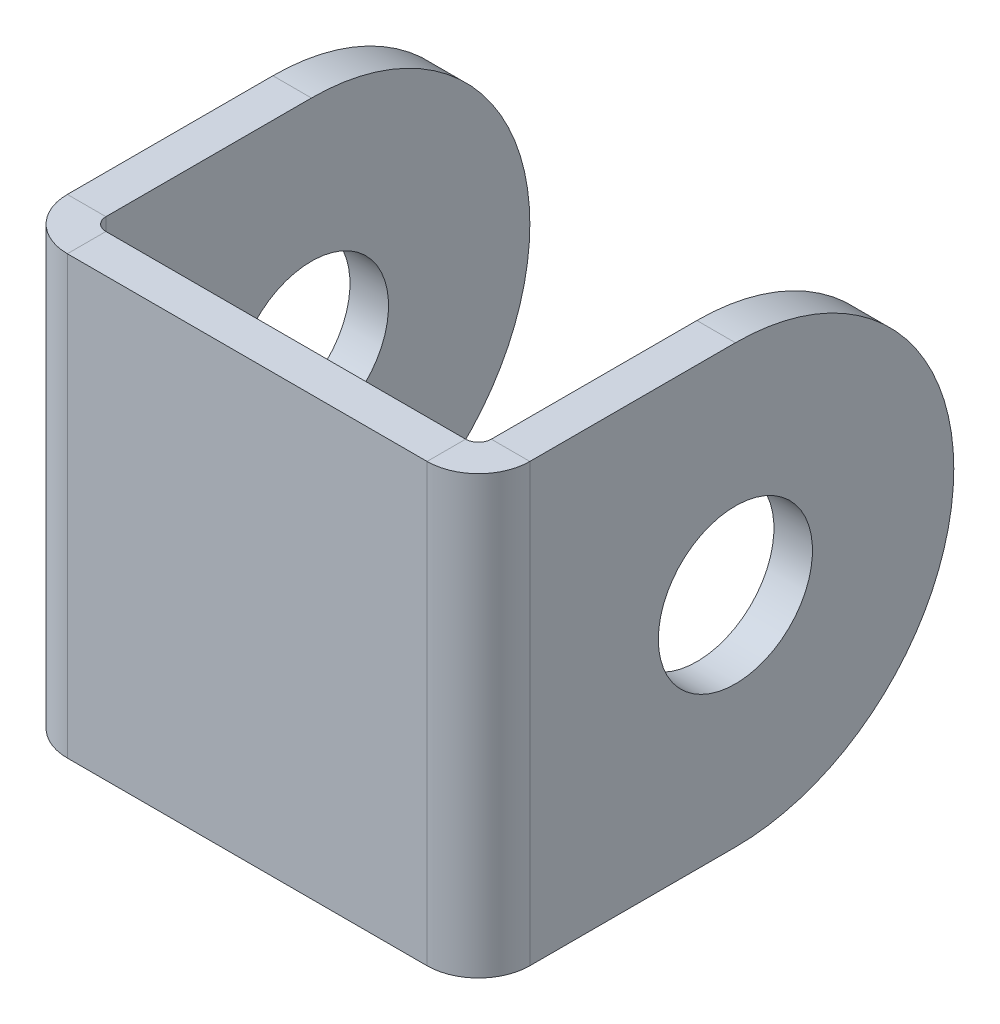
ISO-10303-21;
HEADER;
FILE_DESCRIPTION(('STEP AP214'),'2;1');
FILE_NAME('part.step','',(''),(''),'','','');
FILE_SCHEMA(('AUTOMOTIVE_DESIGN { 1 0 10303 214 1 1 1 1 }'));
ENDSEC;
DATA;
#1=APPLICATION_CONTEXT('core data for automotive mechanical design processes');
#2=APPLICATION_PROTOCOL_DEFINITION('international standard','automotive_design',2000,#1);
#3=PRODUCT_CONTEXT('',#1,'mechanical');
#4=PRODUCT('Part','Part','',(#3));
#5=PRODUCT_RELATED_PRODUCT_CATEGORY('part','',(#4));
#6=PRODUCT_DEFINITION_FORMATION('','',#4);
#7=PRODUCT_DEFINITION_CONTEXT('part definition',#1,'design');
#8=PRODUCT_DEFINITION('design','',#6,#7);
#9=PRODUCT_DEFINITION_SHAPE('','',#8);
#10=(LENGTH_UNIT() NAMED_UNIT(*) SI_UNIT(.MILLI.,.METRE.));
#11=(NAMED_UNIT(*) PLANE_ANGLE_UNIT() SI_UNIT($,.RADIAN.));
#12=(NAMED_UNIT(*) SI_UNIT($,.STERADIAN.) SOLID_ANGLE_UNIT());
#13=UNCERTAINTY_MEASURE_WITH_UNIT(LENGTH_MEASURE(1.E-05),#10,'distance_accuracy_value','');
#14=(GEOMETRIC_REPRESENTATION_CONTEXT(3) GLOBAL_UNCERTAINTY_ASSIGNED_CONTEXT((#13)) GLOBAL_UNIT_ASSIGNED_CONTEXT((#10,
#11,#12)) REPRESENTATION_CONTEXT('',''));
#15=CARTESIAN_POINT('',(0.,0.,0.));
#16=DIRECTION('',(0.,0.,1.));
#17=DIRECTION('',(1.,0.,0.));
#18=AXIS2_PLACEMENT_3D('',#15,#16,#17);
#19=CARTESIAN_POINT('',(-18.,34.,0.));
#20=DIRECTION('',(-1.,0.,0.));
#21=DIRECTION('',(0.,0.,1.));
#22=AXIS2_PLACEMENT_3D('',#19,#20,#21);
#23=PLANE('',#22);
#24=DIRECTION('',(0.,-1.,0.));
#25=VECTOR('',#24,1.);
#26=CARTESIAN_POINT('',(-18.,0.,-1.));
#27=LINE('',#26,#25);
#28=CARTESIAN_POINT('',(-18.,34.,-1.00000000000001));
#29=VERTEX_POINT('',#28);
#30=CARTESIAN_POINT('',(-18.,0.,-1.));
#31=VERTEX_POINT('',#30);
#32=EDGE_CURVE('E162',#29,#31,#27,.T.);
#33=ORIENTED_EDGE('',*,*,#32,.F.);
#34=DIRECTION('',(0.,0.,1.));
#35=VECTOR('',#34,1.);
#36=CARTESIAN_POINT('',(-18.,34.,0.));
#37=LINE('',#36,#35);
#38=CARTESIAN_POINT('',(-18.,34.,-17.));
#39=VERTEX_POINT('',#38);
#40=EDGE_CURVE('E11',#39,#29,#37,.T.);
#41=ORIENTED_EDGE('',*,*,#40,.F.);
#42=CARTESIAN_POINT('',(-18.,17.,-17.));
#43=DIRECTION('',(-1.,0.,0.));
#44=DIRECTION('',(0.,0.,1.));
#45=AXIS2_PLACEMENT_3D('',#42,#43,#44);
#46=CIRCLE('',#45,17.);
#47=CARTESIAN_POINT('',(-18.,17.,-34.));
#48=VERTEX_POINT('',#47);
#49=EDGE_CURVE('E181',#39,#48,#46,.T.);
#50=ORIENTED_EDGE('',*,*,#49,.T.);
#51=CARTESIAN_POINT('',(-18.,17.,-17.));
#52=DIRECTION('',(-1.,0.,0.));
#53=DIRECTION('',(0.,0.,1.));
#54=AXIS2_PLACEMENT_3D('',#51,#52,#53);
#55=CIRCLE('',#54,17.);
#56=CARTESIAN_POINT('',(-18.,0.,-17.));
#57=VERTEX_POINT('',#56);
#58=EDGE_CURVE('E167',#48,#57,#55,.T.);
#59=ORIENTED_EDGE('',*,*,#58,.T.);
#60=DIRECTION('',(0.,0.,-1.));
#61=VECTOR('',#60,1.);
#62=CARTESIAN_POINT('',(-18.,0.,0.));
#63=LINE('',#62,#61);
#64=EDGE_CURVE('E163',#31,#57,#63,.T.);
#65=ORIENTED_EDGE('',*,*,#64,.F.);
#66=EDGE_LOOP('',(#33,#41,#50,#59,#65));
#67=FACE_BOUND('',#66,.T.);
#68=CARTESIAN_POINT('',(-18.,17.,-17.));
#69=DIRECTION('',(-1.,0.,0.));
#70=DIRECTION('',(0.,0.,1.));
#71=AXIS2_PLACEMENT_3D('',#68,#69,#70);
#72=CIRCLE('',#71,6.);
#73=CARTESIAN_POINT('',(-18.,17.,-11.));
#74=VERTEX_POINT('',#73);
#75=EDGE_CURVE('E158',#74,#74,#72,.T.);
#76=ORIENTED_EDGE('',*,*,#75,.F.);
#77=EDGE_LOOP('',(#76));
#78=FACE_BOUND('',#77,.T.);
#79=ADVANCED_FACE('F28',(#67,#78),#23,.T.);
#80=CARTESIAN_POINT('',(18.,17.,-17.));
#81=DIRECTION('',(-1.,0.,0.));
#82=DIRECTION('',(0.,0.,1.));
#83=AXIS2_PLACEMENT_3D('',#80,#81,#82);
#84=CYLINDRICAL_SURFACE('',#83,6.);
#85=ORIENTED_EDGE('',*,*,#75,.T.);
#86=EDGE_LOOP('',(#85));
#87=FACE_BOUND('',#86,.T.);
#88=CARTESIAN_POINT('',(-15.,17.,-17.));
#89=DIRECTION('',(-1.,0.,0.));
#90=DIRECTION('',(0.,0.,1.));
#91=AXIS2_PLACEMENT_3D('',#88,#89,#90);
#92=CIRCLE('',#91,6.);
#93=CARTESIAN_POINT('',(-15.,17.,-11.));
#94=VERTEX_POINT('',#93);
#95=EDGE_CURVE('E212',#94,#94,#92,.T.);
#96=ORIENTED_EDGE('',*,*,#95,.F.);
#97=EDGE_LOOP('',(#96));
#98=FACE_BOUND('',#97,.T.);
#99=ADVANCED_FACE('F203',(#87,#98),#84,.F.);
#100=CARTESIAN_POINT('',(-15.,34.,0.));
#101=DIRECTION('',(-1.,0.,0.));
#102=DIRECTION('',(0.,0.,1.));
#103=AXIS2_PLACEMENT_3D('',#100,#101,#102);
#104=PLANE('',#103);
#105=ORIENTED_EDGE('',*,*,#95,.T.);
#106=EDGE_LOOP('',(#105));
#107=FACE_BOUND('',#106,.T.);
#108=DIRECTION('',(0.,0.,1.));
#109=VECTOR('',#108,1.);
#110=CARTESIAN_POINT('',(-15.,34.,0.));
#111=LINE('',#110,#109);
#112=CARTESIAN_POINT('',(-15.,34.,-17.));
#113=VERTEX_POINT('',#112);
#114=CARTESIAN_POINT('',(-15.,34.,-1.));
#115=VERTEX_POINT('',#114);
#116=EDGE_CURVE('E36',#113,#115,#111,.T.);
#117=ORIENTED_EDGE('',*,*,#116,.T.);
#118=DIRECTION('',(0.,-1.,0.));
#119=VECTOR('',#118,1.);
#120=CARTESIAN_POINT('',(-15.,0.,-1.));
#121=LINE('',#120,#119);
#122=CARTESIAN_POINT('',(-15.,0.,-1.));
#123=VERTEX_POINT('',#122);
#124=EDGE_CURVE('E148',#115,#123,#121,.T.);
#125=ORIENTED_EDGE('',*,*,#124,.T.);
#126=DIRECTION('',(0.,0.,-1.));
#127=VECTOR('',#126,1.);
#128=CARTESIAN_POINT('',(-15.,0.,0.));
#129=LINE('',#128,#127);
#130=CARTESIAN_POINT('',(-15.,0.,-17.));
#131=VERTEX_POINT('',#130);
#132=EDGE_CURVE('E156',#123,#131,#129,.T.);
#133=ORIENTED_EDGE('',*,*,#132,.T.);
#134=CARTESIAN_POINT('',(-15.,17.,-17.));
#135=DIRECTION('',(-1.,0.,0.));
#136=DIRECTION('',(0.,0.,1.));
#137=AXIS2_PLACEMENT_3D('',#134,#135,#136);
#138=CIRCLE('',#137,17.);
#139=CARTESIAN_POINT('',(-15.,17.,-34.));
#140=VERTEX_POINT('',#139);
#141=EDGE_CURVE('E43',#131,#140,#138,.F.);
#142=ORIENTED_EDGE('',*,*,#141,.T.);
#143=CARTESIAN_POINT('',(-15.,17.,-17.));
#144=DIRECTION('',(-1.,0.,0.));
#145=DIRECTION('',(0.,0.,1.));
#146=AXIS2_PLACEMENT_3D('',#143,#144,#145);
#147=CIRCLE('',#146,17.);
#148=EDGE_CURVE('E51',#140,#113,#147,.F.);
#149=ORIENTED_EDGE('',*,*,#148,.T.);
#150=EDGE_LOOP('',(#117,#125,#133,#142,#149));
#151=FACE_BOUND('',#150,.T.);
#152=ADVANCED_FACE('F161',(#107,#151),#104,.F.);
#153=CARTESIAN_POINT('',(76.7628619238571,0.,0.));
#154=DIRECTION('',(0.,1.,0.));
#155=DIRECTION('',(-1.,0.,0.));
#156=AXIS2_PLACEMENT_3D('',#153,#154,#155);
#157=PLANE('',#156);
#158=ORIENTED_EDGE('',*,*,#64,.T.);
#159=DIRECTION('',(-1.,0.,0.));
#160=VECTOR('',#159,1.);
#161=CARTESIAN_POINT('',(76.7628619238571,0.,-17.));
#162=LINE('',#161,#160);
#163=EDGE_CURVE('E142',#131,#57,#162,.T.);
#164=ORIENTED_EDGE('',*,*,#163,.F.);
#165=ORIENTED_EDGE('',*,*,#132,.F.);
#166=DIRECTION('',(-1.,0.,0.));
#167=VECTOR('',#166,1.);
#168=CARTESIAN_POINT('',(76.7628619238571,0.,-0.99999999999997));
#169=LINE('',#168,#167);
#170=EDGE_CURVE('E131',#123,#31,#169,.T.);
#171=ORIENTED_EDGE('',*,*,#170,.T.);
#172=EDGE_LOOP('',(#158,#164,#165,#171));
#173=FACE_BOUND('',#172,.T.);
#174=ADVANCED_FACE('F30',(#173),#157,.F.);
#175=CARTESIAN_POINT('',(76.7628619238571,17.,-17.));
#176=DIRECTION('',(-1.,0.,0.));
#177=DIRECTION('',(0.,0.,1.));
#178=AXIS2_PLACEMENT_3D('',#175,#176,#177);
#179=CYLINDRICAL_SURFACE('',#178,17.);
#180=ORIENTED_EDGE('',*,*,#58,.F.);
#181=DIRECTION('',(-1.,0.,0.));
#182=VECTOR('',#181,1.);
#183=CARTESIAN_POINT('',(76.7628619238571,17.,-34.));
#184=LINE('',#183,#182);
#185=EDGE_CURVE('E175',#140,#48,#184,.T.);
#186=ORIENTED_EDGE('',*,*,#185,.F.);
#187=ORIENTED_EDGE('',*,*,#141,.F.);
#188=ORIENTED_EDGE('',*,*,#163,.T.);
#189=EDGE_LOOP('',(#180,#186,#187,#188));
#190=FACE_BOUND('',#189,.T.);
#191=ADVANCED_FACE('F178',(#190),#179,.T.);
#192=CARTESIAN_POINT('',(76.7628619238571,17.,-17.));
#193=DIRECTION('',(-1.,0.,0.));
#194=DIRECTION('',(0.,0.,1.));
#195=AXIS2_PLACEMENT_3D('',#192,#193,#194);
#196=CYLINDRICAL_SURFACE('',#195,17.);
#197=ORIENTED_EDGE('',*,*,#49,.F.);
#198=DIRECTION('',(-1.,0.,0.));
#199=VECTOR('',#198,1.);
#200=CARTESIAN_POINT('',(76.7628619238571,34.,-17.));
#201=LINE('',#200,#199);
#202=EDGE_CURVE('E172',#113,#39,#201,.T.);
#203=ORIENTED_EDGE('',*,*,#202,.F.);
#204=ORIENTED_EDGE('',*,*,#148,.F.);
#205=ORIENTED_EDGE('',*,*,#185,.T.);
#206=EDGE_LOOP('',(#197,#203,#204,#205));
#207=FACE_BOUND('',#206,.T.);
#208=ADVANCED_FACE('F183',(#207),#196,.T.);
#209=CARTESIAN_POINT('',(76.7628619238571,34.,0.));
#210=DIRECTION('',(0.,1.,0.));
#211=DIRECTION('',(-1.,0.,0.));
#212=AXIS2_PLACEMENT_3D('',#209,#210,#211);
#213=PLANE('',#212);
#214=ORIENTED_EDGE('',*,*,#202,.T.);
#215=ORIENTED_EDGE('',*,*,#40,.T.);
#216=DIRECTION('',(-1.,0.,0.));
#217=VECTOR('',#216,1.);
#218=CARTESIAN_POINT('',(76.7628619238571,34.,-0.99999999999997));
#219=LINE('',#218,#217);
#220=EDGE_CURVE('E165',#115,#29,#219,.T.);
#221=ORIENTED_EDGE('',*,*,#220,.F.);
#222=ORIENTED_EDGE('',*,*,#116,.F.);
#223=EDGE_LOOP('',(#214,#215,#221,#222));
#224=FACE_BOUND('',#223,.T.);
#225=ADVANCED_FACE('F186',(#224),#213,.T.);
#226=CARTESIAN_POINT('',(18.,34.,0.));
#227=DIRECTION('',(-1.,0.,0.));
#228=DIRECTION('',(0.,0.,1.));
#229=AXIS2_PLACEMENT_3D('',#226,#227,#228);
#230=PLANE('',#229);
#231=CARTESIAN_POINT('',(18.,17.,-17.));
#232=DIRECTION('',(-1.,0.,0.));
#233=DIRECTION('',(0.,0.,1.));
#234=AXIS2_PLACEMENT_3D('',#231,#232,#233);
#235=CIRCLE('',#234,6.);
#236=CARTESIAN_POINT('',(18.,17.,-11.));
#237=VERTEX_POINT('',#236);
#238=EDGE_CURVE('E247',#237,#237,#235,.T.);
#239=ORIENTED_EDGE('',*,*,#238,.T.);
#240=EDGE_LOOP('',(#239));
#241=FACE_BOUND('',#240,.T.);
#242=DIRECTION('',(0.,0.,-1.));
#243=VECTOR('',#242,1.);
#244=CARTESIAN_POINT('',(18.,34.,0.));
#245=LINE('',#244,#243);
#246=CARTESIAN_POINT('',(18.,34.,-1.));
#247=VERTEX_POINT('',#246);
#248=CARTESIAN_POINT('',(18.,34.,-17.));
#249=VERTEX_POINT('',#248);
#250=EDGE_CURVE('E239',#247,#249,#245,.T.);
#251=ORIENTED_EDGE('',*,*,#250,.F.);
#252=DIRECTION('',(0.,-1.,0.));
#253=VECTOR('',#252,1.);
#254=CARTESIAN_POINT('',(18.,34.,-1.));
#255=LINE('',#254,#253);
#256=CARTESIAN_POINT('',(18.,0.,-0.999999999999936));
#257=VERTEX_POINT('',#256);
#258=EDGE_CURVE('E234',#247,#257,#255,.T.);
#259=ORIENTED_EDGE('',*,*,#258,.T.);
#260=DIRECTION('',(0.,0.,-1.));
#261=VECTOR('',#260,1.);
#262=CARTESIAN_POINT('',(18.,0.,0.));
#263=LINE('',#262,#261);
#264=CARTESIAN_POINT('',(18.,0.,-17.));
#265=VERTEX_POINT('',#264);
#266=EDGE_CURVE('E215',#257,#265,#263,.T.);
#267=ORIENTED_EDGE('',*,*,#266,.T.);
#268=CARTESIAN_POINT('',(18.,17.,-17.));
#269=DIRECTION('',(-1.,0.,0.));
#270=DIRECTION('',(0.,0.,1.));
#271=AXIS2_PLACEMENT_3D('',#268,#269,#270);
#272=CIRCLE('',#271,17.);
#273=CARTESIAN_POINT('',(18.,17.,-34.));
#274=VERTEX_POINT('',#273);
#275=EDGE_CURVE('E244',#265,#274,#272,.F.);
#276=ORIENTED_EDGE('',*,*,#275,.T.);
#277=CARTESIAN_POINT('',(18.,17.,-17.));
#278=DIRECTION('',(-1.,0.,0.));
#279=DIRECTION('',(0.,0.,1.));
#280=AXIS2_PLACEMENT_3D('',#277,#278,#279);
#281=CIRCLE('',#280,17.);
#282=EDGE_CURVE('E241',#274,#249,#281,.F.);
#283=ORIENTED_EDGE('',*,*,#282,.T.);
#284=EDGE_LOOP('',(#251,#259,#267,#276,#283));
#285=FACE_BOUND('',#284,.T.);
#286=ADVANCED_FACE('F331',(#241,#285),#230,.F.);
#287=CARTESIAN_POINT('',(18.,17.,-17.));
#288=DIRECTION('',(-1.,0.,0.));
#289=DIRECTION('',(0.,0.,1.));
#290=AXIS2_PLACEMENT_3D('',#287,#288,#289);
#291=CYLINDRICAL_SURFACE('',#290,6.);
#292=CARTESIAN_POINT('',(15.,17.,-17.));
#293=DIRECTION('',(-1.,0.,0.));
#294=DIRECTION('',(0.,0.,1.));
#295=AXIS2_PLACEMENT_3D('',#292,#293,#294);
#296=CIRCLE('',#295,6.);
#297=CARTESIAN_POINT('',(15.,17.,-11.));
#298=VERTEX_POINT('',#297);
#299=EDGE_CURVE('E256',#298,#298,#296,.T.);
#300=ORIENTED_EDGE('',*,*,#299,.T.);
#301=EDGE_LOOP('',(#300));
#302=FACE_BOUND('',#301,.T.);
#303=ORIENTED_EDGE('',*,*,#238,.F.);
#304=EDGE_LOOP('',(#303));
#305=FACE_BOUND('',#304,.T.);
#306=ADVANCED_FACE('F390',(#302,#305),#291,.F.);
#307=CARTESIAN_POINT('',(15.,34.,0.));
#308=DIRECTION('',(-1.,0.,0.));
#309=DIRECTION('',(0.,0.,1.));
#310=AXIS2_PLACEMENT_3D('',#307,#308,#309);
#311=PLANE('',#310);
#312=DIRECTION('',(0.,-1.,0.));
#313=VECTOR('',#312,1.);
#314=CARTESIAN_POINT('',(15.,34.,-1.));
#315=LINE('',#314,#313);
#316=CARTESIAN_POINT('',(15.,34.,-0.999999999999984));
#317=VERTEX_POINT('',#316);
#318=CARTESIAN_POINT('',(15.,0.,-0.999999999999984));
#319=VERTEX_POINT('',#318);
#320=EDGE_CURVE('E237',#317,#319,#315,.T.);
#321=ORIENTED_EDGE('',*,*,#320,.F.);
#322=DIRECTION('',(0.,0.,-1.));
#323=VECTOR('',#322,1.);
#324=CARTESIAN_POINT('',(15.,34.,0.));
#325=LINE('',#324,#323);
#326=CARTESIAN_POINT('',(15.,34.,-17.));
#327=VERTEX_POINT('',#326);
#328=EDGE_CURVE('E250',#317,#327,#325,.T.);
#329=ORIENTED_EDGE('',*,*,#328,.T.);
#330=CARTESIAN_POINT('',(15.,17.,-17.));
#331=DIRECTION('',(-1.,0.,0.));
#332=DIRECTION('',(0.,0.,1.));
#333=AXIS2_PLACEMENT_3D('',#330,#331,#332);
#334=CIRCLE('',#333,17.);
#335=CARTESIAN_POINT('',(15.,17.,-34.));
#336=VERTEX_POINT('',#335);
#337=EDGE_CURVE('E254',#327,#336,#334,.T.);
#338=ORIENTED_EDGE('',*,*,#337,.T.);
#339=CARTESIAN_POINT('',(15.,17.,-17.));
#340=DIRECTION('',(-1.,0.,0.));
#341=DIRECTION('',(0.,0.,1.));
#342=AXIS2_PLACEMENT_3D('',#339,#340,#341);
#343=CIRCLE('',#342,17.);
#344=CARTESIAN_POINT('',(15.,0.,-17.));
#345=VERTEX_POINT('',#344);
#346=EDGE_CURVE('E252',#336,#345,#343,.T.);
#347=ORIENTED_EDGE('',*,*,#346,.T.);
#348=DIRECTION('',(0.,0.,-1.));
#349=VECTOR('',#348,1.);
#350=CARTESIAN_POINT('',(15.,0.,0.));
#351=LINE('',#350,#349);
#352=EDGE_CURVE('E218',#319,#345,#351,.T.);
#353=ORIENTED_EDGE('',*,*,#352,.F.);
#354=EDGE_LOOP('',(#321,#329,#338,#347,#353));
#355=FACE_BOUND('',#354,.T.);
#356=ORIENTED_EDGE('',*,*,#299,.F.);
#357=EDGE_LOOP('',(#356));
#358=FACE_BOUND('',#357,.T.);
#359=ADVANCED_FACE('F319',(#355,#358),#311,.T.);
#360=CARTESIAN_POINT('',(-76.7628619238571,34.,0.));
#361=DIRECTION('',(0.,-1.,0.));
#362=DIRECTION('',(-1.,0.,0.));
#363=AXIS2_PLACEMENT_3D('',#360,#361,#362);
#364=PLANE('',#363);
#365=DIRECTION('',(1.,0.,0.));
#366=VECTOR('',#365,1.);
#367=CARTESIAN_POINT('',(-76.7628619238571,34.,-0.99999999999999));
#368=LINE('',#367,#366);
#369=EDGE_CURVE('E221',#317,#247,#368,.T.);
#370=ORIENTED_EDGE('',*,*,#369,.T.);
#371=ORIENTED_EDGE('',*,*,#250,.T.);
#372=DIRECTION('',(1.,0.,0.));
#373=VECTOR('',#372,1.);
#374=CARTESIAN_POINT('',(-76.7628619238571,34.,-17.));
#375=LINE('',#374,#373);
#376=EDGE_CURVE('E224',#327,#249,#375,.T.);
#377=ORIENTED_EDGE('',*,*,#376,.F.);
#378=ORIENTED_EDGE('',*,*,#328,.F.);
#379=EDGE_LOOP('',(#370,#371,#377,#378));
#380=FACE_BOUND('',#379,.T.);
#381=ADVANCED_FACE('F325',(#380),#364,.F.);
#382=CARTESIAN_POINT('',(-76.7628619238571,17.,-17.));
#383=DIRECTION('',(1.,0.,0.));
#384=DIRECTION('',(0.,0.,-1.));
#385=AXIS2_PLACEMENT_3D('',#382,#383,#384);
#386=CYLINDRICAL_SURFACE('',#385,17.);
#387=ORIENTED_EDGE('',*,*,#376,.T.);
#388=ORIENTED_EDGE('',*,*,#282,.F.);
#389=DIRECTION('',(1.,0.,0.));
#390=VECTOR('',#389,1.);
#391=CARTESIAN_POINT('',(-76.7628619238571,17.,-34.));
#392=LINE('',#391,#390);
#393=EDGE_CURVE('E227',#336,#274,#392,.T.);
#394=ORIENTED_EDGE('',*,*,#393,.F.);
#395=ORIENTED_EDGE('',*,*,#337,.F.);
#396=EDGE_LOOP('',(#387,#388,#394,#395));
#397=FACE_BOUND('',#396,.T.);
#398=ADVANCED_FACE('F328',(#397),#386,.T.);
#399=CARTESIAN_POINT('',(-76.7628619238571,17.,-17.));
#400=DIRECTION('',(1.,0.,0.));
#401=DIRECTION('',(0.,0.,-1.));
#402=AXIS2_PLACEMENT_3D('',#399,#400,#401);
#403=CYLINDRICAL_SURFACE('',#402,17.);
#404=ORIENTED_EDGE('',*,*,#393,.T.);
#405=ORIENTED_EDGE('',*,*,#275,.F.);
#406=DIRECTION('',(1.,0.,0.));
#407=VECTOR('',#406,1.);
#408=CARTESIAN_POINT('',(-76.7628619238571,0.,-17.));
#409=LINE('',#408,#407);
#410=EDGE_CURVE('E230',#345,#265,#409,.T.);
#411=ORIENTED_EDGE('',*,*,#410,.F.);
#412=ORIENTED_EDGE('',*,*,#346,.F.);
#413=EDGE_LOOP('',(#404,#405,#411,#412));
#414=FACE_BOUND('',#413,.T.);
#415=ADVANCED_FACE('F336',(#414),#403,.T.);
#416=CARTESIAN_POINT('',(-76.7628619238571,0.,0.));
#417=DIRECTION('',(0.,-1.,0.));
#418=DIRECTION('',(-1.,0.,0.));
#419=AXIS2_PLACEMENT_3D('',#416,#417,#418);
#420=PLANE('',#419);
#421=ORIENTED_EDGE('',*,*,#266,.F.);
#422=DIRECTION('',(1.,0.,0.));
#423=VECTOR('',#422,1.);
#424=CARTESIAN_POINT('',(-76.7628619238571,0.,-0.99999999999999));
#425=LINE('',#424,#423);
#426=EDGE_CURVE('E232',#319,#257,#425,.T.);
#427=ORIENTED_EDGE('',*,*,#426,.F.);
#428=ORIENTED_EDGE('',*,*,#352,.T.);
#429=ORIENTED_EDGE('',*,*,#410,.T.);
#430=EDGE_LOOP('',(#421,#427,#428,#429));
#431=FACE_BOUND('',#430,.T.);
#432=ADVANCED_FACE('F339',(#431),#420,.T.);
#433=CARTESIAN_POINT('',(-15.,0.,-85.090862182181));
#434=DIRECTION('',(0.,-1.,0.));
#435=DIRECTION('',(0.,0.,-1.));
#436=AXIS2_PLACEMENT_3D('',#433,#434,#435);
#437=PLANE('',#436);
#438=DIRECTION('',(1.,0.,0.));
#439=VECTOR('',#438,1.);
#440=CARTESIAN_POINT('',(-15.,0.,3.));
#441=LINE('',#440,#439);
#442=CARTESIAN_POINT('',(-14.,0.,3.));
#443=VERTEX_POINT('',#442);
#444=CARTESIAN_POINT('',(14.,0.,3.));
#445=VERTEX_POINT('',#444);
#446=EDGE_CURVE('E285',#443,#445,#441,.T.);
#447=ORIENTED_EDGE('',*,*,#446,.F.);
#448=DIRECTION('',(0.,0.,1.));
#449=VECTOR('',#448,1.);
#450=CARTESIAN_POINT('',(-14.,0.,-85.090862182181));
#451=LINE('',#450,#449);
#452=CARTESIAN_POINT('',(-14.,0.,0.));
#453=VERTEX_POINT('',#452);
#454=EDGE_CURVE('E264',#453,#443,#451,.T.);
#455=ORIENTED_EDGE('',*,*,#454,.F.);
#456=DIRECTION('',(1.,0.,0.));
#457=VECTOR('',#456,1.);
#458=CARTESIAN_POINT('',(-15.,0.,0.));
#459=LINE('',#458,#457);
#460=CARTESIAN_POINT('',(14.,0.,0.));
#461=VERTEX_POINT('',#460);
#462=EDGE_CURVE('E278',#453,#461,#459,.T.);
#463=ORIENTED_EDGE('',*,*,#462,.T.);
#464=DIRECTION('',(0.,0.,1.));
#465=VECTOR('',#464,1.);
#466=CARTESIAN_POINT('',(14.,0.,-85.090862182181));
#467=LINE('',#466,#465);
#468=EDGE_CURVE('E271',#461,#445,#467,.T.);
#469=ORIENTED_EDGE('',*,*,#468,.T.);
#470=EDGE_LOOP('',(#447,#455,#463,#469));
#471=FACE_BOUND('',#470,.T.);
#472=ADVANCED_FACE('F304',(#471),#437,.T.);
#473=CARTESIAN_POINT('',(-15.,34.,-85.090862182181));
#474=DIRECTION('',(0.,-1.,0.));
#475=DIRECTION('',(0.,0.,-1.));
#476=AXIS2_PLACEMENT_3D('',#473,#474,#475);
#477=PLANE('',#476);
#478=DIRECTION('',(0.,0.,1.));
#479=VECTOR('',#478,1.);
#480=CARTESIAN_POINT('',(-14.,34.,-85.090862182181));
#481=LINE('',#480,#479);
#482=CARTESIAN_POINT('',(-14.,34.,0.));
#483=VERTEX_POINT('',#482);
#484=CARTESIAN_POINT('',(-14.,34.,3.));
#485=VERTEX_POINT('',#484);
#486=EDGE_CURVE('E266',#483,#485,#481,.T.);
#487=ORIENTED_EDGE('',*,*,#486,.T.);
#488=DIRECTION('',(1.,0.,0.));
#489=VECTOR('',#488,1.);
#490=CARTESIAN_POINT('',(-15.,34.,3.));
#491=LINE('',#490,#489);
#492=CARTESIAN_POINT('',(14.,34.,3.));
#493=VERTEX_POINT('',#492);
#494=EDGE_CURVE('E282',#485,#493,#491,.T.);
#495=ORIENTED_EDGE('',*,*,#494,.T.);
#496=DIRECTION('',(0.,0.,1.));
#497=VECTOR('',#496,1.);
#498=CARTESIAN_POINT('',(14.,34.,-85.090862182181));
#499=LINE('',#498,#497);
#500=CARTESIAN_POINT('',(14.,34.,0.));
#501=VERTEX_POINT('',#500);
#502=EDGE_CURVE('E269',#501,#493,#499,.T.);
#503=ORIENTED_EDGE('',*,*,#502,.F.);
#504=DIRECTION('',(1.,0.,0.));
#505=VECTOR('',#504,1.);
#506=CARTESIAN_POINT('',(-15.,34.,0.));
#507=LINE('',#506,#505);
#508=EDGE_CURVE('E275',#483,#501,#507,.T.);
#509=ORIENTED_EDGE('',*,*,#508,.F.);
#510=EDGE_LOOP('',(#487,#495,#503,#509));
#511=FACE_BOUND('',#510,.T.);
#512=ADVANCED_FACE('F344',(#511),#477,.F.);
#513=CARTESIAN_POINT('',(-15.,34.,0.));
#514=DIRECTION('',(0.,0.,-1.));
#515=DIRECTION('',(-1.,0.,0.));
#516=AXIS2_PLACEMENT_3D('',#513,#514,#515);
#517=PLANE('',#516);
#518=ORIENTED_EDGE('',*,*,#462,.F.);
#519=DIRECTION('',(0.,1.,0.));
#520=VECTOR('',#519,1.);
#521=CARTESIAN_POINT('',(-14.,0.,0.));
#522=LINE('',#521,#520);
#523=EDGE_CURVE('E151',#453,#483,#522,.T.);
#524=ORIENTED_EDGE('',*,*,#523,.T.);
#525=ORIENTED_EDGE('',*,*,#508,.T.);
#526=DIRECTION('',(0.,-1.,0.));
#527=VECTOR('',#526,1.);
#528=CARTESIAN_POINT('',(14.,34.,0.));
#529=LINE('',#528,#527);
#530=EDGE_CURVE('E261',#501,#461,#529,.T.);
#531=ORIENTED_EDGE('',*,*,#530,.T.);
#532=EDGE_LOOP('',(#518,#524,#525,#531));
#533=FACE_BOUND('',#532,.T.);
#534=ADVANCED_FACE('F347',(#533),#517,.T.);
#535=CARTESIAN_POINT('',(-15.,34.,3.));
#536=DIRECTION('',(0.,0.,-1.));
#537=DIRECTION('',(-1.,0.,0.));
#538=AXIS2_PLACEMENT_3D('',#535,#536,#537);
#539=PLANE('',#538);
#540=DIRECTION('',(0.,1.,0.));
#541=VECTOR('',#540,1.);
#542=CARTESIAN_POINT('',(-14.,0.,3.));
#543=LINE('',#542,#541);
#544=EDGE_CURVE('E198',#443,#485,#543,.T.);
#545=ORIENTED_EDGE('',*,*,#544,.F.);
#546=ORIENTED_EDGE('',*,*,#446,.T.);
#547=DIRECTION('',(0.,-1.,0.));
#548=VECTOR('',#547,1.);
#549=CARTESIAN_POINT('',(14.,34.,3.));
#550=LINE('',#549,#548);
#551=EDGE_CURVE('E259',#493,#445,#550,.T.);
#552=ORIENTED_EDGE('',*,*,#551,.F.);
#553=ORIENTED_EDGE('',*,*,#494,.F.);
#554=EDGE_LOOP('',(#545,#546,#552,#553));
#555=FACE_BOUND('',#554,.T.);
#556=ADVANCED_FACE('F301',(#555),#539,.F.);
#557=CARTESIAN_POINT('',(14.,0.,-1.));
#558=DIRECTION('',(0.,-1.,0.));
#559=DIRECTION('',(0.,0.,-1.));
#560=AXIS2_PLACEMENT_3D('',#557,#558,#559);
#561=PLANE('',#560);
#562=ORIENTED_EDGE('',*,*,#468,.F.);
#563=CARTESIAN_POINT('',(14.,0.,-1.));
#564=DIRECTION('',(0.,-1.,0.));
#565=DIRECTION('',(0.,0.,-1.));
#566=AXIS2_PLACEMENT_3D('',#563,#564,#565);
#567=CIRCLE('',#566,0.999999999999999);
#568=EDGE_CURVE('E294',#461,#319,#567,.F.);
#569=ORIENTED_EDGE('',*,*,#568,.T.);
#570=ORIENTED_EDGE('',*,*,#426,.T.);
#571=CARTESIAN_POINT('',(14.,0.,-1.));
#572=DIRECTION('',(0.,-1.,0.));
#573=DIRECTION('',(0.,0.,-1.));
#574=AXIS2_PLACEMENT_3D('',#571,#572,#573);
#575=CIRCLE('',#574,4.);
#576=EDGE_CURVE('E288',#445,#257,#575,.F.);
#577=ORIENTED_EDGE('',*,*,#576,.F.);
#578=EDGE_LOOP('',(#562,#569,#570,#577));
#579=FACE_BOUND('',#578,.T.);
#580=ADVANCED_FACE('F309',(#579),#561,.T.);
#581=CARTESIAN_POINT('',(14.,34.,-1.));
#582=DIRECTION('',(0.,1.,0.));
#583=DIRECTION('',(0.,0.,1.));
#584=AXIS2_PLACEMENT_3D('',#581,#582,#583);
#585=PLANE('',#584);
#586=ORIENTED_EDGE('',*,*,#369,.F.);
#587=CARTESIAN_POINT('',(14.,34.,-1.));
#588=DIRECTION('',(0.,-1.,0.));
#589=DIRECTION('',(0.,0.,-1.));
#590=AXIS2_PLACEMENT_3D('',#587,#588,#589);
#591=CIRCLE('',#590,0.999999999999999);
#592=EDGE_CURVE('E199',#317,#501,#591,.T.);
#593=ORIENTED_EDGE('',*,*,#592,.T.);
#594=ORIENTED_EDGE('',*,*,#502,.T.);
#595=CARTESIAN_POINT('',(14.,34.,-1.));
#596=DIRECTION('',(0.,-1.,0.));
#597=DIRECTION('',(0.,0.,-1.));
#598=AXIS2_PLACEMENT_3D('',#595,#596,#597);
#599=CIRCLE('',#598,4.);
#600=EDGE_CURVE('E291',#247,#493,#599,.T.);
#601=ORIENTED_EDGE('',*,*,#600,.F.);
#602=EDGE_LOOP('',(#586,#593,#594,#601));
#603=FACE_BOUND('',#602,.T.);
#604=ADVANCED_FACE('F450',(#603),#585,.T.);
#605=CARTESIAN_POINT('',(14.,137.773792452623,-1.));
#606=DIRECTION('',(0.,-1.,0.));
#607=DIRECTION('',(0.,0.,-1.));
#608=AXIS2_PLACEMENT_3D('',#605,#606,#607);
#609=CYLINDRICAL_SURFACE('',#608,4.);
#610=ORIENTED_EDGE('',*,*,#600,.T.);
#611=ORIENTED_EDGE('',*,*,#551,.T.);
#612=ORIENTED_EDGE('',*,*,#576,.T.);
#613=ORIENTED_EDGE('',*,*,#258,.F.);
#614=EDGE_LOOP('',(#610,#611,#612,#613));
#615=FACE_BOUND('',#614,.T.);
#616=ADVANCED_FACE('F342',(#615),#609,.T.);
#617=CARTESIAN_POINT('',(14.,137.773792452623,-1.));
#618=DIRECTION('',(0.,-1.,0.));
#619=DIRECTION('',(0.,0.,-1.));
#620=AXIS2_PLACEMENT_3D('',#617,#618,#619);
#621=CYLINDRICAL_SURFACE('',#620,0.999999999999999);
#622=ORIENTED_EDGE('',*,*,#592,.F.);
#623=ORIENTED_EDGE('',*,*,#320,.T.);
#624=ORIENTED_EDGE('',*,*,#568,.F.);
#625=ORIENTED_EDGE('',*,*,#530,.F.);
#626=EDGE_LOOP('',(#622,#623,#624,#625));
#627=FACE_BOUND('',#626,.T.);
#628=ADVANCED_FACE('F314',(#627),#621,.F.);
#629=CARTESIAN_POINT('',(-14.,34.,-1.));
#630=DIRECTION('',(0.,1.,0.));
#631=DIRECTION('',(0.,0.,1.));
#632=AXIS2_PLACEMENT_3D('',#629,#630,#631);
#633=PLANE('',#632);
#634=ORIENTED_EDGE('',*,*,#486,.F.);
#635=CARTESIAN_POINT('',(-14.,34.,-1.));
#636=DIRECTION('',(0.,1.,0.));
#637=DIRECTION('',(0.,0.,1.));
#638=AXIS2_PLACEMENT_3D('',#635,#636,#637);
#639=CIRCLE('',#638,1.);
#640=EDGE_CURVE('E153',#483,#115,#639,.F.);
#641=ORIENTED_EDGE('',*,*,#640,.T.);
#642=ORIENTED_EDGE('',*,*,#220,.T.);
#643=CARTESIAN_POINT('',(-14.,34.,-1.));
#644=DIRECTION('',(0.,1.,0.));
#645=DIRECTION('',(0.,0.,1.));
#646=AXIS2_PLACEMENT_3D('',#643,#644,#645);
#647=CIRCLE('',#646,4.);
#648=EDGE_CURVE('E192',#485,#29,#647,.F.);
#649=ORIENTED_EDGE('',*,*,#648,.F.);
#650=EDGE_LOOP('',(#634,#641,#642,#649));
#651=FACE_BOUND('',#650,.T.);
#652=ADVANCED_FACE('F191',(#651),#633,.T.);
#653=CARTESIAN_POINT('',(-14.,0.,-1.));
#654=DIRECTION('',(0.,-1.,0.));
#655=DIRECTION('',(0.,0.,-1.));
#656=AXIS2_PLACEMENT_3D('',#653,#654,#655);
#657=PLANE('',#656);
#658=ORIENTED_EDGE('',*,*,#170,.F.);
#659=CARTESIAN_POINT('',(-14.,0.,-1.));
#660=DIRECTION('',(0.,1.,0.));
#661=DIRECTION('',(0.,0.,1.));
#662=AXIS2_PLACEMENT_3D('',#659,#660,#661);
#663=CIRCLE('',#662,1.);
#664=EDGE_CURVE('E134',#123,#453,#663,.T.);
#665=ORIENTED_EDGE('',*,*,#664,.T.);
#666=ORIENTED_EDGE('',*,*,#454,.T.);
#667=CARTESIAN_POINT('',(-14.,0.,-1.));
#668=DIRECTION('',(0.,1.,0.));
#669=DIRECTION('',(0.,0.,1.));
#670=AXIS2_PLACEMENT_3D('',#667,#668,#669);
#671=CIRCLE('',#670,4.);
#672=EDGE_CURVE('E137',#31,#443,#671,.T.);
#673=ORIENTED_EDGE('',*,*,#672,.F.);
#674=EDGE_LOOP('',(#658,#665,#666,#673));
#675=FACE_BOUND('',#674,.T.);
#676=ADVANCED_FACE('F133',(#675),#657,.T.);
#677=CARTESIAN_POINT('',(-14.,-83.7496268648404,-1.));
#678=DIRECTION('',(0.,1.,0.));
#679=DIRECTION('',(0.,0.,1.));
#680=AXIS2_PLACEMENT_3D('',#677,#678,#679);
#681=CYLINDRICAL_SURFACE('',#680,4.);
#682=ORIENTED_EDGE('',*,*,#672,.T.);
#683=ORIENTED_EDGE('',*,*,#544,.T.);
#684=ORIENTED_EDGE('',*,*,#648,.T.);
#685=ORIENTED_EDGE('',*,*,#32,.T.);
#686=EDGE_LOOP('',(#682,#683,#684,#685));
#687=FACE_BOUND('',#686,.T.);
#688=ADVANCED_FACE('F196',(#687),#681,.T.);
#689=CARTESIAN_POINT('',(-14.,-83.7496268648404,-1.));
#690=DIRECTION('',(0.,1.,0.));
#691=DIRECTION('',(0.,0.,1.));
#692=AXIS2_PLACEMENT_3D('',#689,#690,#691);
#693=CYLINDRICAL_SURFACE('',#692,1.);
#694=ORIENTED_EDGE('',*,*,#664,.F.);
#695=ORIENTED_EDGE('',*,*,#124,.F.);
#696=ORIENTED_EDGE('',*,*,#640,.F.);
#697=ORIENTED_EDGE('',*,*,#523,.F.);
#698=EDGE_LOOP('',(#694,#695,#696,#697));
#699=FACE_BOUND('',#698,.T.);
#700=ADVANCED_FACE('F145',(#699),#693,.F.);
#701=CLOSED_SHELL('',(#79,#99,#152,#174,#191,#208,#225,#286,#306,#359,#381,#398,#415,#432,#472,
#512,#534,#556,#580,#604,#616,#628,#652,#676,#688,#700));
#702=MANIFOLD_SOLID_BREP('B2',#701);
#703=ADVANCED_BREP_SHAPE_REPRESENTATION('',(#18,#702),#14);
#704=SHAPE_DEFINITION_REPRESENTATION(#9,#703);
ENDSEC;
END-ISO-10303-21;
